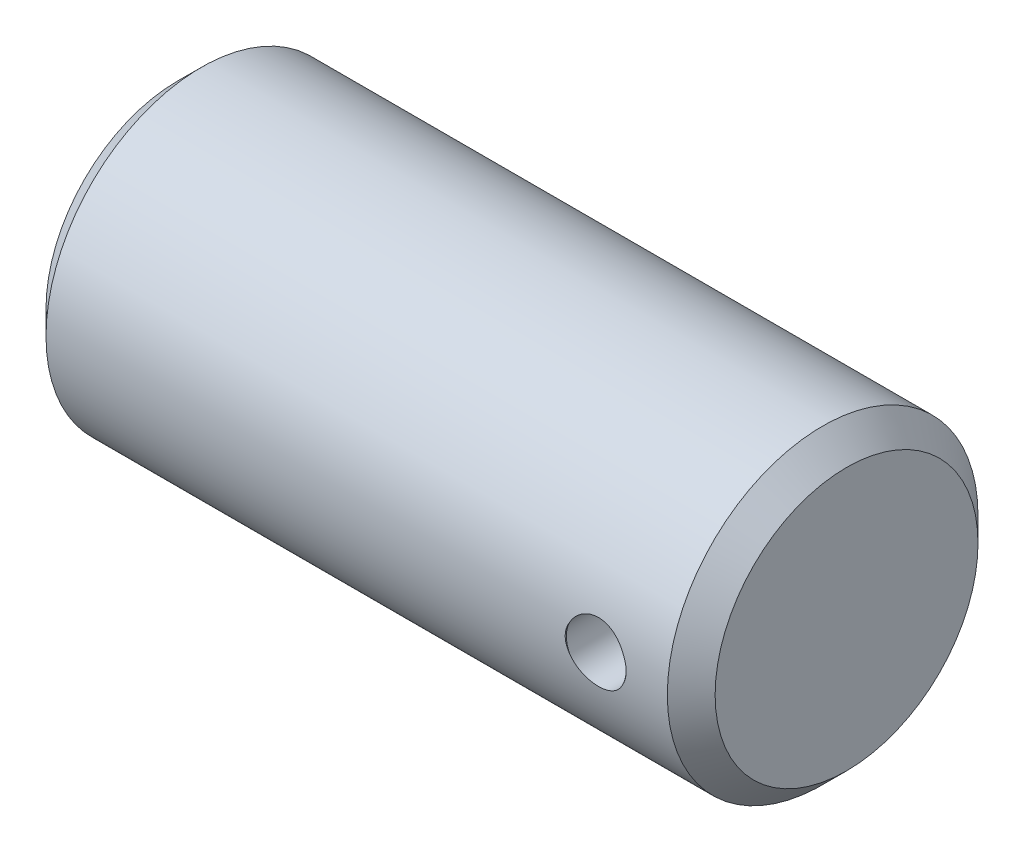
from build123d import *

# Parameters (mm, degrees)
SKETCH_1_W            = 28
SKETCH_1_H            = 6.5
CHAMFER_1_SIZE        = 1
F_2_5MM_3_D           = 2.5
F_2_5MM_3_DEPTH       = 3
F_2_5MM_3_CSINK_D     = 2.55
F_2_5MM_3_CSINK_ANGLE = 90
F_2_5MM_3_TIP         = 0.751075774


with BuildPart() as part:
    # Sketch 1 → Revolve 1 (revolve)
    with BuildSketch(Plane.XY, mode=Mode.PRIVATE) as revolve_1_sk:
        with Locations((14, 3.25)):
            Rectangle(SKETCH_1_W, SKETCH_1_H)
    revolve(revolve_1_sk.sketch.rotate(Axis((0, 0, 0), (1, 0, 0)), 90), axis=Axis((0, 0, 0), (1, 0, 0)))

    # Chamfer 1
    chamfer_1_edges = [part.edges().sort_by_distance(p)[0] for p in [
        (28, 0, -6.5),
        (0, 0, -6.5),
    ]]
    chamfer(chamfer_1_edges, length=CHAMFER_1_SIZE)

    # 2.5mm _3
    with Locations(Plane.XY.offset(6.5)):
        with Locations((24, 0)):
            CounterSinkHole(F_2_5MM_3_D / 2, F_2_5MM_3_CSINK_D / 2, depth=F_2_5MM_3_DEPTH, counter_sink_angle=F_2_5MM_3_CSINK_ANGLE)
            with Locations((0, 0, -(F_2_5MM_3_DEPTH + F_2_5MM_3_TIP / 2))):  # 118° drill point
                Cone(0, F_2_5MM_3_D / 2, F_2_5MM_3_TIP, mode=Mode.SUBTRACT)


solid = part.part
